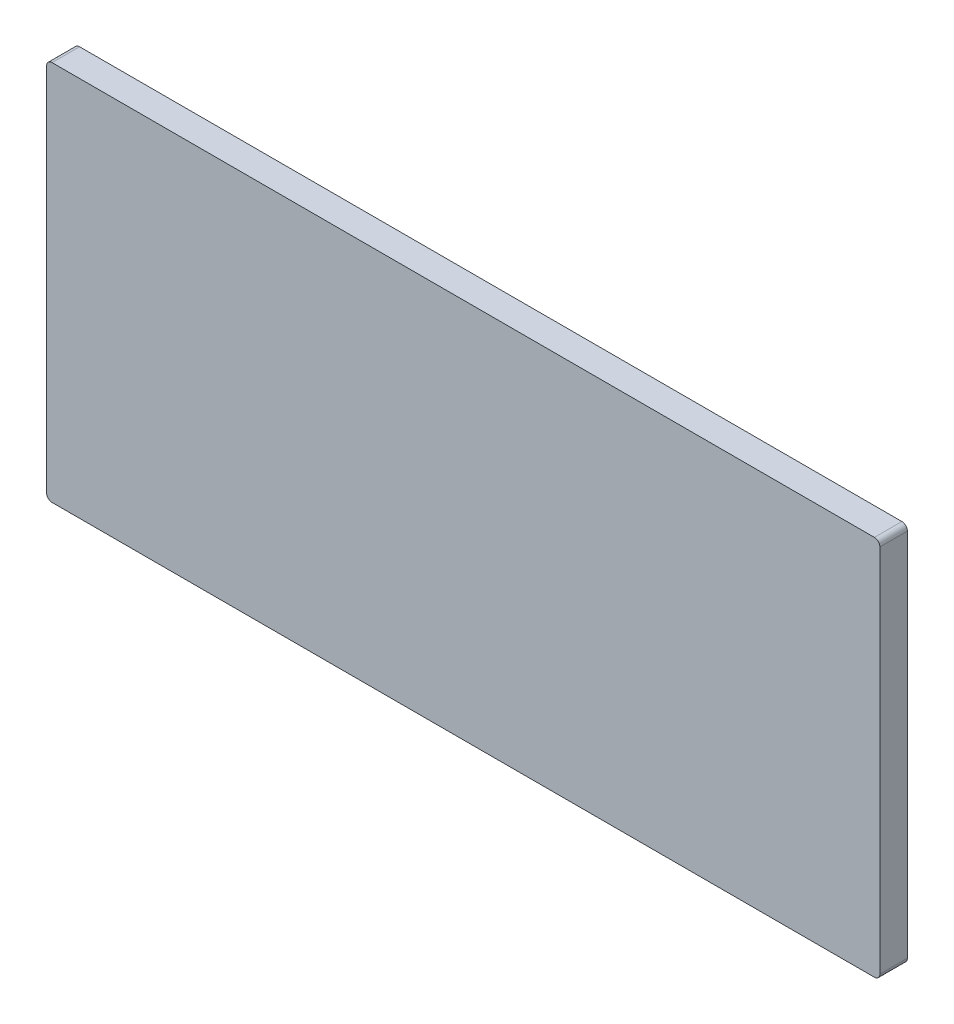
from build123d import *

# Parameters (mm, degrees)
BOSS_EXTRU_1_DEPTH = 10


with BuildPart() as part:
    # Esquisse1 → Boss.-Extru.1 (new body)
    with BuildSketch(Plane.XY):
        with BuildLine():
            Line((-62.392743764, 97.577777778), (236.607256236, 97.577777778))
            ThreePointArc((236.607256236, 97.577777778), (238.021469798, 96.99199134), (238.607256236, 95.577777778))
            Line((238.607256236, 95.577777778), (238.607256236, -38.922222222))
            ThreePointArc((238.607256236, -38.922222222), (238.021469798, -40.336435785), (236.607256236, -40.922222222))
            Line((236.607256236, -40.922222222), (-62.392743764, -40.922222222))
            ThreePointArc((-62.392743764, -40.922222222), (-63.806957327, -40.336435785), (-64.392743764, -38.922222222))
            Line((-64.392743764, -38.922222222), (-64.392743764, 95.577777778))
            ThreePointArc((-64.392743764, 95.577777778), (-63.806957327, 96.99199134), (-62.392743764, 97.577777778))
        make_face()
    extrude(amount=BOSS_EXTRU_1_DEPTH)


solid = part.part
